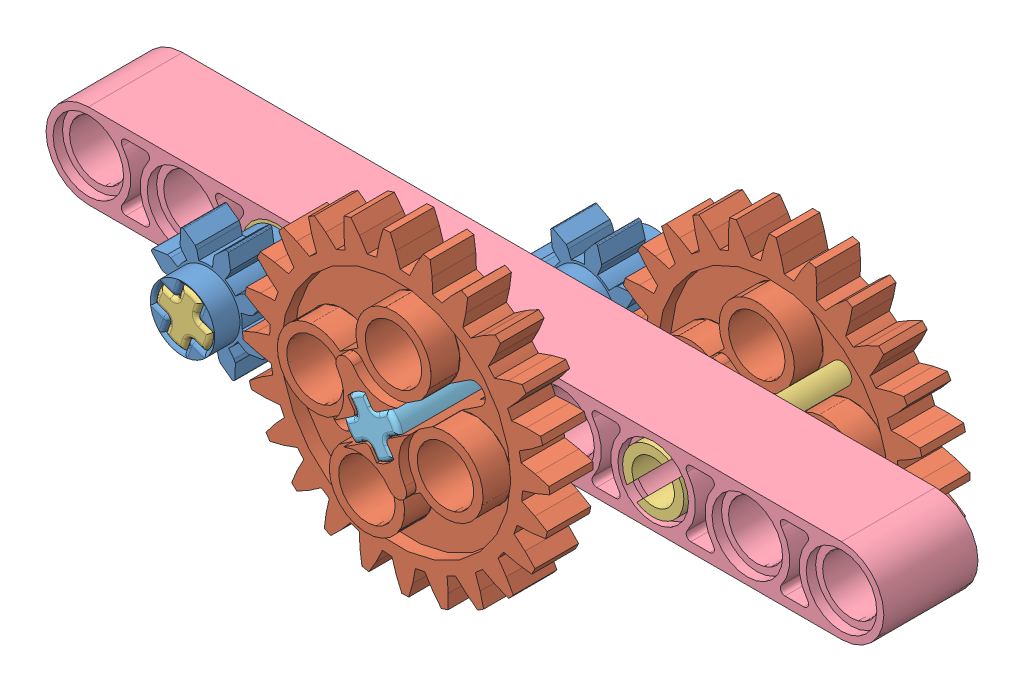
SolidWorks assembly Assem3.sldasm, configuration Default (file format 12000). Lengths in mm.
Overall size (71.2 36.91 24).
8 component instances, 5 part files, 20 mates.
Components (placement in the parent):
- 3647 Gear 8-1: 3647 Gear 8.SLDPRT [Default] at (-5.4053 -0.4786 9.8014) x (-0.551615 0.834099 0) z (-0.834099 -0.551615 0) size (10.06 8 10.06)
- 3648 Gear 24-1: 3648 Gear 24.SLDPRT [Default] at (10.5947 -0.4786 9.8014) x (-0.70696 -0.707253 0) z (0.707253 -0.70696 0) size (26.1 8 26.1)
- 3749 Axle Pin without Friction Ridges Lengthwise-1: 3749 Axle Pin without Friction Ridges Lengthwise.SLDPRT [Default] at (-21.4053 -0.4786 21.8014) x (0.945832 -0.324656 0) z (-0.324656 -0.945832 0) size (6 16 6)
- 40490 Beam 9 Red-1: 40490 Beam 9 Red.SLDPRT [Default] at (-37.4053 -0.4786 13.8014) x (1 0 0) z (0 -1 0) size (71.2 8 7.2)
- 4519 Axle 3-1: 4519 Axle 3.SLDPRT [Default] at (-5.4053 -0.4786 29.8014) x (0.551615 -0.834099 0) z (0.834099 0.551615 0) size (4.8 24 4.8)
- 3749 Axle Pin without Friction Ridges Lengthwise-2: 3749 Axle Pin without Friction Ridges Lengthwise.SLDPRT [Default] at (10.5947 -0.4786 13.8014) x (-0.70696 -0.707253 0) z (0.707253 -0.70696 0) size (6 16 6)
- 3648 Gear 24-2: 3648 Gear 24.SLDPRT [Default] at (-5.4053 -0.4786 25.8014) x (-0.834099 -0.551615 0) z (0.551615 -0.834099 0) size (26.1 8 26.1)
- 3647 Gear 8-2: 3647 Gear 8.SLDPRT [Default] at (-21.4053 -0.4786 25.8014) x (0.324656 0.945832 0) z (0.945832 -0.324656 0) size (10.06 8 10.06)
Mates (geometry in assembly coordinates):
- Concentric2: concentric anti-aligned: cylinder of 3749 Axle Pin without Friction Ridges Lengthwise-1 through (-21.4053 -0.4786 13.8014) axis (0 0 1) radius 2.4; cylinder of 40490 Beam 9 Red-1 through (-21.4053 -0.4786 21.8014) axis (0 0 -1) radius 2.4
- Concentric3: concentric aligned: cylinder of 40490 Beam 9 Red-1 through (10.5947 -0.4786 21.8014) axis (0 0 -1) radius 2.4; cylinder of 3749 Axle Pin without Friction Ridges Lengthwise-2 through (10.5947 -0.4786 21.8014) axis (0 0 -1) radius 2.4
- Coincident2: coincident anti-aligned: plane of 3749 Axle Pin without Friction Ridges Lengthwise-1 through (-21.4053 -0.4786 21.0014) normal (0 0 -1); plane of 40490 Beam 9 Red-1 through (-21.4053 -0.4786 21.0014) normal (0 0 1)
- Coincident3: coincident anti-aligned: plane of 40490 Beam 9 Red-1 through (10.5947 -0.4786 14.6014) normal (0 0 -1); plane of 3749 Axle Pin without Friction Ridges Lengthwise-2 through (10.5947 -0.4786 14.6014) normal (0 0 1)
- Concentric4: concentric anti-aligned: cylinder of 3749 Axle Pin without Friction Ridges Lengthwise-1 through (-21.4053 -0.4786 29.8014) axis (0 0 -1) radius 2.4; cylinder of 3647 Gear 8-2 through (-21.4053 -0.4786 21.8014) axis (0 0 1) radius 2.4
- Coincident4: coincident anti-aligned: plane of 3749 Axle Pin without Friction Ridges Lengthwise-1 through (-21.2979 -2.8762 29.8014) normal (0.945832 -0.324656 0); plane of 3647 Gear 8-2 through (-20.1574 0.4463 21.8014) normal (-0.945832 0.324656 0)
- Coincident5: coincident anti-aligned: plane of 40490 Beam 9 Red-1 through (-37.4053 -0.4786 21.8014) normal (0 0 1); plane of 3647 Gear 8-2 through (-21.4053 -0.4786 21.8014) normal (0 0 -1)
- Concentric5: concentric anti-aligned: cylinder of 3648 Gear 24-1 through (10.5947 -0.4786 13.8014) axis (0 0 -1) radius 2.4; cylinder of 3749 Axle Pin without Friction Ridges Lengthwise-2 through (10.5947 -0.4786 5.8014) axis (0 0 1) radius 2.4
- Coincident6: coincident anti-aligned: plane of 3648 Gear 24-1 through (10.3115 1.0487 13.8014) normal (-0.70696 -0.707253 0); plane of 3749 Axle Pin without Friction Ridges Lengthwise-2 through (9.6376 1.7223 5.8014) normal (0.70696 0.707253 0)
- Coincident7: coincident anti-aligned: plane of 3648 Gear 24-1 through (7.805 2.3623 13.8014) normal (0 0 1); plane of 40490 Beam 9 Red-1 through (-37.4053 -0.4786 13.8014) normal (0 0 -1)
- Concentric6: concentric anti-aligned: cylinder of 3647 Gear 8-1 through (-5.4053 -0.4786 13.8014) axis (0 0 -1) radius 2.4; cylinder of 4519 Axle 3-1 through (-5.4053 -0.4786 5.8014) axis (0 0 1) radius 2.4
- Coincident8: coincident anti-aligned: plane of 3647 Gear 8-1 through (-3.9652 -1.0609 13.8014) normal (-0.834099 -0.551615 0); plane of 4519 Axle 3-1 through (-3.4396 -1.8556 5.8014) normal (0.834099 0.551615 0)
- Coincident9: coincident aligned: plane of 3647 Gear 8-1 through (-5.4053 -0.4786 5.8014) normal (0 0 -1); plane of 4519 Axle 3-1 through (-5.4053 -0.4786 5.8014) normal (0 0 -1)
- Coincident10: coincident anti-aligned: plane of 3647 Gear 8-1 through (-5.4053 -0.4786 13.8014) normal (0 0 1); plane of 40490 Beam 9 Red-1 through (-37.4053 -0.4786 13.8014) normal (0 0 -1)
- Concentric7: concentric anti-aligned: cylinder of 4519 Axle 3-1 through (-5.4053 -0.4786 5.8014) axis (0 0 1) radius 2.4; cylinder of 3648 Gear 24-2 through (-5.4053 -0.4786 29.8014) axis (0 0 -1) radius 2.4
- Coincident11: coincident anti-aligned: plane of 4519 Axle 3-1 through (-3.4396 -1.8556 5.8014) normal (0.834099 0.551615 0); plane of 3648 Gear 24-2 through (-5.3774 1.0744 29.8014) normal (-0.834099 -0.551615 0)
- Coincident12: coincident anti-aligned: plane of 40490 Beam 9 Red-1 through (-37.4053 -0.4786 21.8014) normal (0 0 1); plane of 3648 Gear 24-2 through (-7.5706 2.8627 21.8014) normal (0 0 -1)
- Concentric8: concentric anti-aligned: cylinder of 40490 Beam 9 Red-1 through (-5.4053 -0.4786 21.8014) axis (0 0 -1) radius 2.4; cylinder of 4519 Axle 3-1 through (-5.4053 -0.4786 5.8014) axis (0 0 1) radius 2.4
- GearMate1: gear = 21.5 mm: circle of 3647 Gear 8-2; circle of 3648 Gear 24-2
- GearMate2: gear = 21.5 mm: circle of 3647 Gear 8-1; circle of 3648 Gear 24-1
